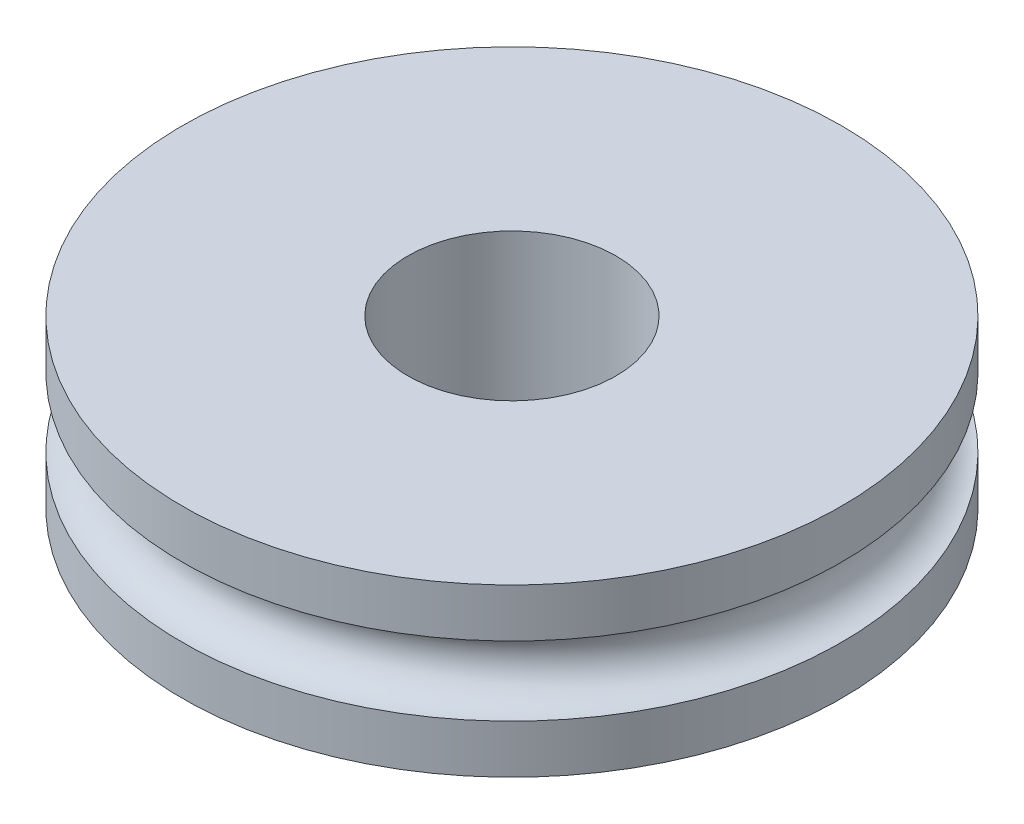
from build123d import *


with BuildPart() as part:
    # Sketch1 → Revolve1 (revolve)
    with BuildSketch(Plane.XY, mode=Mode.PRIVATE) as revolve1_sk:
        with BuildLine():
            Line((1.5, -1.2), (1.5, 1.2))
            Line((1.5, 1.2), (4.75, 1.2))
            Line((4.75, 1.2), (4.75, 0.5))
            ThreePointArc((4.75, 0.5), (4.25, 0), (4.75, -0.5))
            Line((4.75, -0.5), (4.75, -1.2))
            Line((4.75, -1.2), (1.5, -1.2))
        make_face()
    revolve(revolve1_sk.sketch.rotate(Axis((0, 0, 0), (0, 1, 0)), 90), axis=Axis((0, 0, 0), (0, 1, 0)))


solid = part.part
